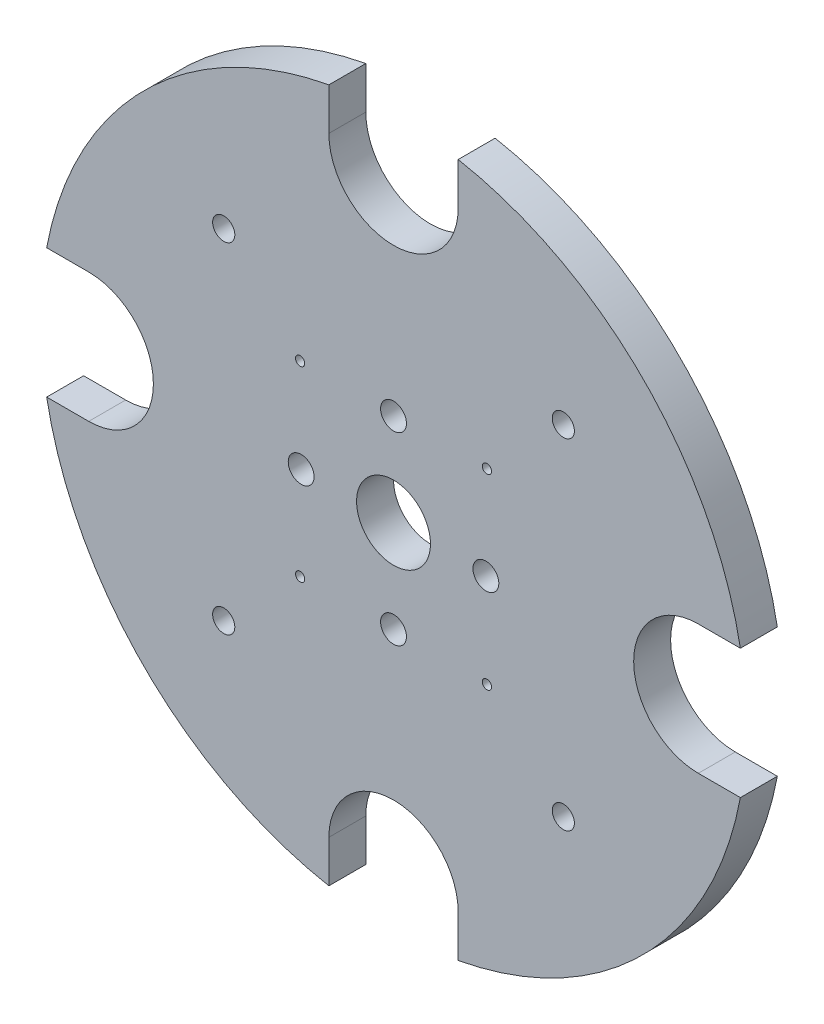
from build123d import *

# Parameters (mm, degrees)
ESQUISSE1_R                  = 191
BASE_EXTRUSION_DEPTH         = 20
ESQUISSE2_R                  = 20
ENL_V_MAT_EXTRU_1_DEPTH      = 20
ESQUISSE3_R                  = 7
ENL_V_MAT_EXTRU_2_DEPTH      = 20
R_P_TITION_CIRCULAIRE1_COUNT = 4
ESQUISSE4_R                  = 6
ESQUISSE4_R_2                = 2.5
ENL_V_MAT_EXTRU_3_DEPTH      = 20
R_P_TITION_CIRCULAIRE2_COUNT = 4
ENL_V_MAT_EXTRU_4_DEPTH      = 271.854204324
R_P_TITION_CIRCULAIRE3_COUNT = 4


with BuildPart() as part:
    # Esquisse1 → Base-Extrusion (new body)
    with BuildSketch(Plane.XY):
        Circle(ESQUISSE1_R)
    extrude(amount=BASE_EXTRUSION_DEPTH)

    # Esquisse2 → Enl_v. mat.-Extru.1 (cut)
    with BuildSketch(Plane.XY.offset(20)):
        Circle(ESQUISSE2_R)
    extrude(amount=-ENL_V_MAT_EXTRU_1_DEPTH, mode=Mode.SUBTRACT)

    # Esquisse3 → Enl_v. mat.-Extru.2 (cut)
    with BuildSketch(Plane.XY.offset(20)):
        with Locations((50, 0)):
            Circle(ESQUISSE3_R)
    enl_v_mat_extru_2 = extrude(amount=-ENL_V_MAT_EXTRU_2_DEPTH, mode=Mode.SUBTRACT)

    # R_p_tition circulaire1: Enl_v. mat.-Extru.2 ×4 about axis
    r_p_tition_circulaire1_axis = Axis((0, 0, 0), (0, 0, -1))
    for i in range(1, R_P_TITION_CIRCULAIRE1_COUNT):
        add(enl_v_mat_extru_2.rotate(r_p_tition_circulaire1_axis, i * 360 / R_P_TITION_CIRCULAIRE1_COUNT), mode=Mode.SUBTRACT)

    # Esquisse4 → Enl_v. mat.-Extru.3 (cut)
    with BuildSketch(Plane.XY.offset(20)):
        with Locations((91.923881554, 91.923881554)):
            Circle(ESQUISSE4_R)
        with Locations((50.558134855, 50.558134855)):
            Circle(ESQUISSE4_R_2)
    enl_v_mat_extru_3 = extrude(amount=-ENL_V_MAT_EXTRU_3_DEPTH, mode=Mode.SUBTRACT)

    # R_p_tition circulaire2: Enl_v. mat.-Extru.3 ×4 about axis
    r_p_tition_circulaire2_axis = Axis((0, 0, 0), (0, 0, -1))
    for i in range(1, R_P_TITION_CIRCULAIRE2_COUNT):
        add(enl_v_mat_extru_3.rotate(r_p_tition_circulaire2_axis, i * 360 / R_P_TITION_CIRCULAIRE2_COUNT), mode=Mode.SUBTRACT)

    # Esquisse5 → Enl_v. mat.-Extru.4 (cut, through all)
    with BuildSketch(Plane.XY.offset(20)):
        with BuildLine():
            Line((-35, 187.765811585), (-35, 165))
            ThreePointArc((-35, 165), (0, 130), (35, 165))
            Line((35, 165), (35, 187.765811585))
            ThreePointArc((35, 187.765811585), (0, 191), (-35, 187.765811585))
        make_face()
    enl_v_mat_extru_4 = extrude(amount=-ENL_V_MAT_EXTRU_4_DEPTH, mode=Mode.SUBTRACT)

    # R_p_tition circulaire3: Enl_v. mat.-Extru.4 ×4 about axis
    r_p_tition_circulaire3_axis = Axis((0, 0, 0), (0, 0, -1))
    for i in range(1, R_P_TITION_CIRCULAIRE3_COUNT):
        add(enl_v_mat_extru_4.rotate(r_p_tition_circulaire3_axis, i * 360 / R_P_TITION_CIRCULAIRE3_COUNT), mode=Mode.SUBTRACT)


solid = part.part
